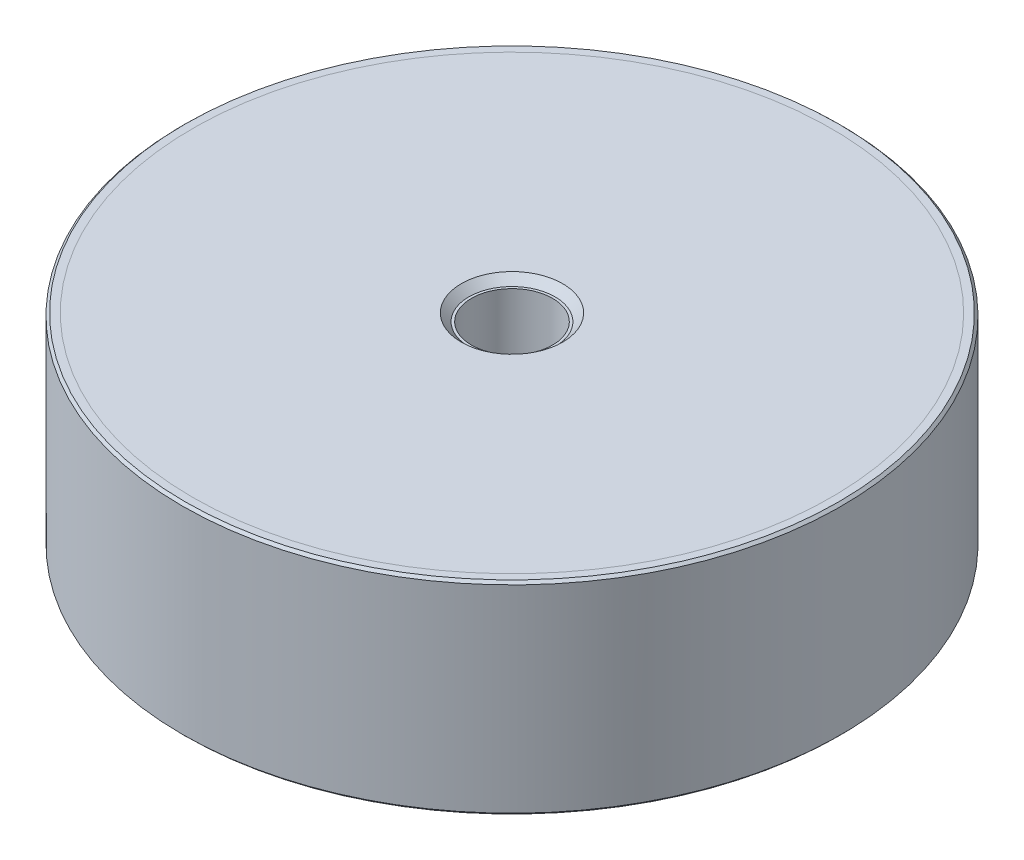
ISO-10303-21;
HEADER;
FILE_DESCRIPTION(('STEP AP214'),'2;1');
FILE_NAME('part.step','',(''),(''),'','','');
FILE_SCHEMA(('AUTOMOTIVE_DESIGN { 1 0 10303 214 1 1 1 1 }'));
ENDSEC;
DATA;
#1=APPLICATION_CONTEXT('core data for automotive mechanical design processes');
#2=APPLICATION_PROTOCOL_DEFINITION('international standard','automotive_design',2000,#1);
#3=PRODUCT_CONTEXT('',#1,'mechanical');
#4=PRODUCT('Part','Part','',(#3));
#5=PRODUCT_RELATED_PRODUCT_CATEGORY('part','',(#4));
#6=PRODUCT_DEFINITION_FORMATION('','',#4);
#7=PRODUCT_DEFINITION_CONTEXT('part definition',#1,'design');
#8=PRODUCT_DEFINITION('design','',#6,#7);
#9=PRODUCT_DEFINITION_SHAPE('','',#8);
#10=(LENGTH_UNIT() NAMED_UNIT(*) SI_UNIT(.MILLI.,.METRE.));
#11=(NAMED_UNIT(*) PLANE_ANGLE_UNIT() SI_UNIT($,.RADIAN.));
#12=(NAMED_UNIT(*) SI_UNIT($,.STERADIAN.) SOLID_ANGLE_UNIT());
#13=UNCERTAINTY_MEASURE_WITH_UNIT(LENGTH_MEASURE(1.E-05),#10,'distance_accuracy_value','');
#14=(GEOMETRIC_REPRESENTATION_CONTEXT(3) GLOBAL_UNCERTAINTY_ASSIGNED_CONTEXT((#13)) GLOBAL_UNIT_ASSIGNED_CONTEXT((#10,
#11,#12)) REPRESENTATION_CONTEXT('',''));
#15=CARTESIAN_POINT('',(0.,0.,0.));
#16=DIRECTION('',(0.,0.,1.));
#17=DIRECTION('',(1.,0.,0.));
#18=AXIS2_PLACEMENT_3D('',#15,#16,#17);
#19=CARTESIAN_POINT('',(0.,-37.,8.));
#20=DIRECTION('',(0.,1.,0.));
#21=DIRECTION('',(0.,0.,1.));
#22=AXIS2_PLACEMENT_3D('',#19,#20,#21);
#23=PLANE('',#22);
#24=CARTESIAN_POINT('',(0.,-37.,0.));
#25=DIRECTION('',(0.,1.,0.));
#26=DIRECTION('',(0.,0.,1.));
#27=AXIS2_PLACEMENT_3D('',#24,#25,#26);
#28=CIRCLE('',#27,8.50000000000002);
#29=CARTESIAN_POINT('',(0.,-37.,8.50000000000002));
#30=VERTEX_POINT('',#29);
#31=EDGE_CURVE('P0_E10',#30,#30,#28,.F.);
#32=ORIENTED_EDGE('',*,*,#31,.T.);
#33=EDGE_LOOP('',(#32));
#34=FACE_BOUND('',#33,.T.);
#35=CARTESIAN_POINT('',(0.,-37.,0.));
#36=DIRECTION('',(0.,1.,0.));
#37=DIRECTION('',(0.,0.,1.));
#38=AXIS2_PLACEMENT_3D('',#35,#36,#37);
#39=CIRCLE('',#38,63.);
#40=CARTESIAN_POINT('',(0.,-37.,63.));
#41=VERTEX_POINT('',#40);
#42=EDGE_CURVE('P0_E25',#41,#41,#39,.T.);
#43=ORIENTED_EDGE('',*,*,#42,.T.);
#44=EDGE_LOOP('',(#43));
#45=FACE_BOUND('',#44,.T.);
#46=ADVANCED_FACE('P0_F14',(#34,#45),#23,.T.);
#47=CARTESIAN_POINT('',(0.,31.0340428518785,0.));
#48=DIRECTION('',(0.,1.,0.));
#49=DIRECTION('',(0.,0.,1.));
#50=AXIS2_PLACEMENT_3D('',#47,#48,#49);
#51=CYLINDRICAL_SURFACE('',#50,63.);
#52=CARTESIAN_POINT('',(0.,-38.5,0.));
#53=DIRECTION('',(0.,1.,0.));
#54=DIRECTION('',(0.,0.,1.));
#55=AXIS2_PLACEMENT_3D('',#52,#53,#54);
#56=CIRCLE('',#55,63.);
#57=CARTESIAN_POINT('',(0.,-38.5,63.));
#58=VERTEX_POINT('',#57);
#59=EDGE_CURVE('P0_E29',#58,#58,#56,.T.);
#60=ORIENTED_EDGE('',*,*,#59,.T.);
#61=EDGE_LOOP('',(#60));
#62=FACE_BOUND('',#61,.T.);
#63=ORIENTED_EDGE('',*,*,#42,.F.);
#64=EDGE_LOOP('',(#63));
#65=FACE_BOUND('',#64,.T.);
#66=ADVANCED_FACE('P0_F35',(#62,#65),#51,.T.);
#67=CARTESIAN_POINT('',(0.,-38.5,63.));
#68=DIRECTION('',(0.,-1.,0.));
#69=DIRECTION('',(0.,0.,-1.));
#70=AXIS2_PLACEMENT_3D('',#67,#68,#69);
#71=PLANE('',#70);
#72=CARTESIAN_POINT('',(0.,-38.5,0.));
#73=DIRECTION('',(0.,-1.,0.));
#74=DIRECTION('',(0.,0.,-1.));
#75=AXIS2_PLACEMENT_3D('',#72,#73,#74);
#76=CIRCLE('',#75,10.);
#77=CARTESIAN_POINT('',(0.,-38.5,-10.));
#78=VERTEX_POINT('',#77);
#79=EDGE_CURVE('P0_E21',#78,#78,#76,.F.);
#80=ORIENTED_EDGE('',*,*,#79,.T.);
#81=EDGE_LOOP('',(#80));
#82=FACE_BOUND('',#81,.T.);
#83=ORIENTED_EDGE('',*,*,#59,.F.);
#84=EDGE_LOOP('',(#83));
#85=FACE_BOUND('',#84,.T.);
#86=ADVANCED_FACE('P0_F38',(#82,#85),#71,.T.);
#87=CARTESIAN_POINT('',(0.,-38.5,0.));
#88=DIRECTION('',(0.,-1.,0.));
#89=DIRECTION('',(0.,0.,-1.));
#90=AXIS2_PLACEMENT_3D('',#87,#88,#89);
#91=CONICAL_SURFACE('',#90,10.,0.785398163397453);
#92=ORIENTED_EDGE('',*,*,#31,.F.);
#93=EDGE_LOOP('',(#92));
#94=FACE_BOUND('',#93,.T.);
#95=ORIENTED_EDGE('',*,*,#79,.F.);
#96=EDGE_LOOP('',(#95));
#97=FACE_BOUND('',#96,.T.);
#98=ADVANCED_FACE('P0_F16',(#94,#97),#91,.F.);
#99=CLOSED_SHELL('',(#46,#66,#86,#98));
#100=MANIFOLD_SOLID_BREP('P0_B1',#99);
#101=CARTESIAN_POINT('',(0.,1.5,8.));
#102=DIRECTION('',(0.,1.,0.));
#103=DIRECTION('',(0.,0.,1.));
#104=AXIS2_PLACEMENT_3D('',#101,#102,#103);
#105=PLANE('',#104);
#106=CARTESIAN_POINT('',(0.,1.5,0.));
#107=DIRECTION('',(0.,1.,0.));
#108=DIRECTION('',(0.,0.,1.));
#109=AXIS2_PLACEMENT_3D('',#106,#107,#108);
#110=CIRCLE('',#109,10.);
#111=CARTESIAN_POINT('',(0.,1.5,10.));
#112=VERTEX_POINT('',#111);
#113=EDGE_CURVE('P1_E10',#112,#112,#110,.F.);
#114=ORIENTED_EDGE('',*,*,#113,.T.);
#115=EDGE_LOOP('',(#114));
#116=FACE_BOUND('',#115,.T.);
#117=CARTESIAN_POINT('',(0.,1.49999999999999,0.));
#118=DIRECTION('',(0.,1.,0.));
#119=DIRECTION('',(0.,0.,1.));
#120=AXIS2_PLACEMENT_3D('',#117,#118,#119);
#121=CIRCLE('',#120,63.);
#122=CARTESIAN_POINT('',(0.,1.49999999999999,63.));
#123=VERTEX_POINT('',#122);
#124=EDGE_CURVE('P1_E25',#123,#123,#121,.T.);
#125=ORIENTED_EDGE('',*,*,#124,.T.);
#126=EDGE_LOOP('',(#125));
#127=FACE_BOUND('',#126,.T.);
#128=ADVANCED_FACE('P1_F14',(#116,#127),#105,.T.);
#129=CARTESIAN_POINT('',(0.,69.5340428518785,0.));
#130=DIRECTION('',(0.,1.,0.));
#131=DIRECTION('',(0.,0.,1.));
#132=AXIS2_PLACEMENT_3D('',#129,#130,#131);
#133=CYLINDRICAL_SURFACE('',#132,63.);
#134=CARTESIAN_POINT('',(0.,0.,0.));
#135=DIRECTION('',(0.,1.,0.));
#136=DIRECTION('',(0.,0.,1.));
#137=AXIS2_PLACEMENT_3D('',#134,#135,#136);
#138=CIRCLE('',#137,63.);
#139=CARTESIAN_POINT('',(0.,0.,63.));
#140=VERTEX_POINT('',#139);
#141=EDGE_CURVE('P1_E29',#140,#140,#138,.T.);
#142=ORIENTED_EDGE('',*,*,#141,.T.);
#143=EDGE_LOOP('',(#142));
#144=FACE_BOUND('',#143,.T.);
#145=ORIENTED_EDGE('',*,*,#124,.F.);
#146=EDGE_LOOP('',(#145));
#147=FACE_BOUND('',#146,.T.);
#148=ADVANCED_FACE('P1_F35',(#144,#147),#133,.T.);
#149=CARTESIAN_POINT('',(0.,0.,63.));
#150=DIRECTION('',(0.,-1.,0.));
#151=DIRECTION('',(0.,0.,-1.));
#152=AXIS2_PLACEMENT_3D('',#149,#150,#151);
#153=PLANE('',#152);
#154=CARTESIAN_POINT('',(0.,0.,0.));
#155=DIRECTION('',(0.,-1.,0.));
#156=DIRECTION('',(0.,0.,-1.));
#157=AXIS2_PLACEMENT_3D('',#154,#155,#156);
#158=CIRCLE('',#157,8.50000000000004);
#159=CARTESIAN_POINT('',(0.,0.,-8.50000000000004));
#160=VERTEX_POINT('',#159);
#161=EDGE_CURVE('P1_E21',#160,#160,#158,.F.);
#162=ORIENTED_EDGE('',*,*,#161,.T.);
#163=EDGE_LOOP('',(#162));
#164=FACE_BOUND('',#163,.T.);
#165=ORIENTED_EDGE('',*,*,#141,.F.);
#166=EDGE_LOOP('',(#165));
#167=FACE_BOUND('',#166,.T.);
#168=ADVANCED_FACE('P1_F38',(#164,#167),#153,.T.);
#169=CARTESIAN_POINT('',(0.,-0.500000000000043,0.));
#170=DIRECTION('',(0.,1.,0.));
#171=DIRECTION('',(0.,0.,1.));
#172=AXIS2_PLACEMENT_3D('',#169,#170,#171);
#173=CONICAL_SURFACE('',#172,8.,0.785398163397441);
#174=ORIENTED_EDGE('',*,*,#113,.F.);
#175=EDGE_LOOP('',(#174));
#176=FACE_BOUND('',#175,.T.);
#177=ORIENTED_EDGE('',*,*,#161,.F.);
#178=EDGE_LOOP('',(#177));
#179=FACE_BOUND('',#178,.T.);
#180=ADVANCED_FACE('P1_F16',(#176,#179),#173,.F.);
#181=CLOSED_SHELL('',(#128,#148,#168,#180));
#182=MANIFOLD_SOLID_BREP('P1_B1',#181);
#183=CARTESIAN_POINT('',(0.,0.,0.));
#184=DIRECTION('',(0.,1.,0.));
#185=DIRECTION('',(0.,0.,1.));
#186=AXIS2_PLACEMENT_3D('',#183,#184,#185);
#187=PLANE('',#186);
#188=CARTESIAN_POINT('',(0.,0.,0.));
#189=DIRECTION('',(0.,1.,0.));
#190=DIRECTION('',(0.,0.,1.));
#191=AXIS2_PLACEMENT_3D('',#188,#189,#190);
#192=CIRCLE('',#191,8.);
#193=CARTESIAN_POINT('',(0.,0.,8.));
#194=VERTEX_POINT('',#193);
#195=EDGE_CURVE('P2_E46',#194,#194,#192,.T.);
#196=ORIENTED_EDGE('',*,*,#195,.F.);
#197=EDGE_LOOP('',(#196));
#198=FACE_BOUND('',#197,.T.);
#199=CARTESIAN_POINT('',(0.,0.,0.));
#200=DIRECTION('',(0.,1.,0.));
#201=DIRECTION('',(0.,0.,1.));
#202=AXIS2_PLACEMENT_3D('',#199,#200,#201);
#203=CIRCLE('',#202,63.);
#204=CARTESIAN_POINT('',(0.,0.,63.));
#205=VERTEX_POINT('',#204);
#206=EDGE_CURVE('P2_E33',#205,#205,#203,.T.);
#207=ORIENTED_EDGE('',*,*,#206,.T.);
#208=EDGE_LOOP('',(#207));
#209=FACE_BOUND('',#208,.T.);
#210=ADVANCED_FACE('P2_F13',(#198,#209),#187,.T.);
#211=CARTESIAN_POINT('',(0.,65.5134936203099,0.));
#212=DIRECTION('',(0.,1.,0.));
#213=DIRECTION('',(0.,0.,1.));
#214=AXIS2_PLACEMENT_3D('',#211,#212,#213);
#215=CYLINDRICAL_SURFACE('',#214,63.);
#216=CARTESIAN_POINT('',(0.,1.49999999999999,0.));
#217=DIRECTION('',(0.,1.,0.));
#218=DIRECTION('',(0.,0.,1.));
#219=AXIS2_PLACEMENT_3D('',#216,#217,#218);
#220=CIRCLE('',#219,63.);
#221=CARTESIAN_POINT('',(0.,1.49999999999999,63.));
#222=VERTEX_POINT('',#221);
#223=EDGE_CURVE('P2_E36',#222,#222,#220,.T.);
#224=ORIENTED_EDGE('',*,*,#223,.T.);
#225=EDGE_LOOP('',(#224));
#226=FACE_BOUND('',#225,.T.);
#227=ORIENTED_EDGE('',*,*,#206,.F.);
#228=EDGE_LOOP('',(#227));
#229=FACE_BOUND('',#228,.T.);
#230=ADVANCED_FACE('P2_F92',(#226,#229),#215,.F.);
#231=CARTESIAN_POINT('',(0.,1.49999999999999,63.));
#232=DIRECTION('',(0.,1.,0.));
#233=DIRECTION('',(0.,0.,1.));
#234=AXIS2_PLACEMENT_3D('',#231,#232,#233);
#235=PLANE('',#234);
#236=CARTESIAN_POINT('',(0.,1.49999999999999,0.));
#237=DIRECTION('',(0.,1.,0.));
#238=DIRECTION('',(0.,0.,1.));
#239=AXIS2_PLACEMENT_3D('',#236,#237,#238);
#240=CIRCLE('',#239,64.5);
#241=CARTESIAN_POINT('',(0.,1.49999999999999,64.5));
#242=VERTEX_POINT('',#241);
#243=EDGE_CURVE('P2_E9',#242,#242,#240,.T.);
#244=ORIENTED_EDGE('',*,*,#243,.T.);
#245=EDGE_LOOP('',(#244));
#246=FACE_BOUND('',#245,.T.);
#247=ORIENTED_EDGE('',*,*,#223,.F.);
#248=EDGE_LOOP('',(#247));
#249=FACE_BOUND('',#248,.T.);
#250=ADVANCED_FACE('P2_F88',(#246,#249),#235,.T.);
#251=CARTESIAN_POINT('',(0.,65.5134936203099,0.));
#252=DIRECTION('',(0.,1.,0.));
#253=DIRECTION('',(0.,0.,1.));
#254=AXIS2_PLACEMENT_3D('',#251,#252,#253);
#255=CYLINDRICAL_SURFACE('',#254,65.);
#256=CARTESIAN_POINT('',(0.,-38.,0.));
#257=DIRECTION('',(0.,-1.,0.));
#258=DIRECTION('',(0.,0.,-1.));
#259=AXIS2_PLACEMENT_3D('',#256,#257,#258);
#260=CIRCLE('',#259,65.);
#261=CARTESIAN_POINT('',(0.,-38.,-65.));
#262=VERTEX_POINT('',#261);
#263=EDGE_CURVE('P2_E24',#262,#262,#260,.F.);
#264=ORIENTED_EDGE('',*,*,#263,.T.);
#265=EDGE_LOOP('',(#264));
#266=FACE_BOUND('',#265,.T.);
#267=CARTESIAN_POINT('',(0.,0.999999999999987,0.));
#268=DIRECTION('',(0.,1.,0.));
#269=DIRECTION('',(0.,0.,1.));
#270=AXIS2_PLACEMENT_3D('',#267,#268,#269);
#271=CIRCLE('',#270,65.);
#272=CARTESIAN_POINT('',(0.,0.999999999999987,65.));
#273=VERTEX_POINT('',#272);
#274=EDGE_CURVE('P2_E28',#273,#273,#271,.F.);
#275=ORIENTED_EDGE('',*,*,#274,.T.);
#276=EDGE_LOOP('',(#275));
#277=FACE_BOUND('',#276,.T.);
#278=ADVANCED_FACE('P2_F82',(#266,#277),#255,.T.);
#279=CARTESIAN_POINT('',(0.,-38.5,65.));
#280=DIRECTION('',(0.,-1.,0.));
#281=DIRECTION('',(0.,0.,-1.));
#282=AXIS2_PLACEMENT_3D('',#279,#280,#281);
#283=PLANE('',#282);
#284=CARTESIAN_POINT('',(0.,-38.5,0.));
#285=DIRECTION('',(0.,-1.,0.));
#286=DIRECTION('',(0.,0.,-1.));
#287=AXIS2_PLACEMENT_3D('',#284,#285,#286);
#288=CIRCLE('',#287,64.5);
#289=CARTESIAN_POINT('',(0.,-38.5,-64.5));
#290=VERTEX_POINT('',#289);
#291=EDGE_CURVE('P2_E20',#290,#290,#288,.T.);
#292=ORIENTED_EDGE('',*,*,#291,.T.);
#293=EDGE_LOOP('',(#292));
#294=FACE_BOUND('',#293,.T.);
#295=CARTESIAN_POINT('',(0.,-38.5,0.));
#296=DIRECTION('',(0.,1.,0.));
#297=DIRECTION('',(0.,0.,1.));
#298=AXIS2_PLACEMENT_3D('',#295,#296,#297);
#299=CIRCLE('',#298,63.);
#300=CARTESIAN_POINT('',(0.,-38.5,63.));
#301=VERTEX_POINT('',#300);
#302=EDGE_CURVE('P2_E39',#301,#301,#299,.T.);
#303=ORIENTED_EDGE('',*,*,#302,.T.);
#304=EDGE_LOOP('',(#303));
#305=FACE_BOUND('',#304,.T.);
#306=ADVANCED_FACE('P2_F77',(#294,#305),#283,.T.);
#307=CARTESIAN_POINT('',(0.,65.5134936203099,0.));
#308=DIRECTION('',(0.,1.,0.));
#309=DIRECTION('',(0.,0.,1.));
#310=AXIS2_PLACEMENT_3D('',#307,#308,#309);
#311=CYLINDRICAL_SURFACE('',#310,63.);
#312=CARTESIAN_POINT('',(0.,-37.,0.));
#313=DIRECTION('',(0.,1.,0.));
#314=DIRECTION('',(0.,0.,1.));
#315=AXIS2_PLACEMENT_3D('',#312,#313,#314);
#316=CIRCLE('',#315,63.);
#317=CARTESIAN_POINT('',(0.,-37.,63.));
#318=VERTEX_POINT('',#317);
#319=EDGE_CURVE('P2_E42',#318,#318,#316,.T.);
#320=ORIENTED_EDGE('',*,*,#319,.T.);
#321=EDGE_LOOP('',(#320));
#322=FACE_BOUND('',#321,.T.);
#323=ORIENTED_EDGE('',*,*,#302,.F.);
#324=EDGE_LOOP('',(#323));
#325=FACE_BOUND('',#324,.T.);
#326=ADVANCED_FACE('P2_F71',(#322,#325),#311,.F.);
#327=CARTESIAN_POINT('',(0.,-37.,63.));
#328=DIRECTION('',(0.,-1.,0.));
#329=DIRECTION('',(0.,0.,-1.));
#330=AXIS2_PLACEMENT_3D('',#327,#328,#329);
#331=PLANE('',#330);
#332=CARTESIAN_POINT('',(0.,-37.,0.));
#333=DIRECTION('',(0.,-1.,0.));
#334=DIRECTION('',(0.,0.,-1.));
#335=AXIS2_PLACEMENT_3D('',#332,#333,#334);
#336=CIRCLE('',#335,8.);
#337=CARTESIAN_POINT('',(0.,-37.,-8.));
#338=VERTEX_POINT('',#337);
#339=EDGE_CURVE('P2_E52',#338,#338,#336,.T.);
#340=ORIENTED_EDGE('',*,*,#339,.F.);
#341=EDGE_LOOP('',(#340));
#342=FACE_BOUND('',#341,.T.);
#343=ORIENTED_EDGE('',*,*,#319,.F.);
#344=EDGE_LOOP('',(#343));
#345=FACE_BOUND('',#344,.T.);
#346=ADVANCED_FACE('P2_F67',(#342,#345),#331,.T.);
#347=CARTESIAN_POINT('',(0.,-38.,0.));
#348=DIRECTION('',(0.,1.,0.));
#349=DIRECTION('',(0.,0.,1.));
#350=AXIS2_PLACEMENT_3D('',#347,#348,#349);
#351=CONICAL_SURFACE('',#350,65.,0.785398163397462);
#352=ORIENTED_EDGE('',*,*,#291,.F.);
#353=EDGE_LOOP('',(#352));
#354=FACE_BOUND('',#353,.T.);
#355=ORIENTED_EDGE('',*,*,#263,.F.);
#356=EDGE_LOOP('',(#355));
#357=FACE_BOUND('',#356,.T.);
#358=ADVANCED_FACE('P2_F70',(#354,#357),#351,.T.);
#359=CARTESIAN_POINT('',(0.,1.49999999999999,0.));
#360=DIRECTION('',(0.,-1.,0.));
#361=DIRECTION('',(0.,0.,-1.));
#362=AXIS2_PLACEMENT_3D('',#359,#360,#361);
#363=CONICAL_SURFACE('',#362,64.5,0.785398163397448);
#364=ORIENTED_EDGE('',*,*,#274,.F.);
#365=EDGE_LOOP('',(#364));
#366=FACE_BOUND('',#365,.T.);
#367=ORIENTED_EDGE('',*,*,#243,.F.);
#368=EDGE_LOOP('',(#367));
#369=FACE_BOUND('',#368,.T.);
#370=ADVANCED_FACE('P2_F15',(#366,#369),#363,.T.);
#371=CARTESIAN_POINT('',(0.,-14.5,0.));
#372=DIRECTION('',(0.,1.,0.));
#373=DIRECTION('',(0.,0.,1.));
#374=AXIS2_PLACEMENT_3D('',#371,#372,#373);
#375=CYLINDRICAL_SURFACE('',#374,8.);
#376=CARTESIAN_POINT('',(0.,-14.5,0.));
#377=DIRECTION('',(0.,1.,0.));
#378=DIRECTION('',(0.,0.,1.));
#379=AXIS2_PLACEMENT_3D('',#376,#377,#378);
#380=CIRCLE('',#379,8.);
#381=CARTESIAN_POINT('',(0.,-14.5,8.));
#382=VERTEX_POINT('',#381);
#383=EDGE_CURVE('P2_E45',#382,#382,#380,.T.);
#384=CARTESIAN_POINT('',(0.,-14.5,8.));
#385=CARTESIAN_POINT('',(0.,-14.3489583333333,8.));
#386=CARTESIAN_POINT('',(0.,-14.1979166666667,8.));
#387=CARTESIAN_POINT('',(0.,-13.8958333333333,8.));
#388=CARTESIAN_POINT('',(0.,-13.7447916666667,8.));
#389=CARTESIAN_POINT('',(0.,-13.4427083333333,8.));
#390=CARTESIAN_POINT('',(0.,-13.2916666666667,8.));
#391=CARTESIAN_POINT('',(0.,-12.9895833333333,8.));
#392=CARTESIAN_POINT('',(0.,-12.8385416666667,8.));
#393=CARTESIAN_POINT('',(0.,-12.5364583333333,8.));
#394=CARTESIAN_POINT('',(0.,-12.3854166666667,8.));
#395=CARTESIAN_POINT('',(0.,-12.0833333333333,8.));
#396=CARTESIAN_POINT('',(0.,-11.9322916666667,8.));
#397=CARTESIAN_POINT('',(0.,-11.6302083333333,8.));
#398=CARTESIAN_POINT('',(0.,-11.4791666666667,8.));
#399=CARTESIAN_POINT('',(0.,-11.1770833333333,8.));
#400=CARTESIAN_POINT('',(0.,-11.0260416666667,8.));
#401=CARTESIAN_POINT('',(0.,-10.7239583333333,8.));
#402=CARTESIAN_POINT('',(0.,-10.5729166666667,8.));
#403=CARTESIAN_POINT('',(0.,-10.2708333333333,8.));
#404=CARTESIAN_POINT('',(0.,-10.1197916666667,8.));
#405=CARTESIAN_POINT('',(0.,-9.81770833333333,8.));
#406=CARTESIAN_POINT('',(0.,-9.66666666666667,8.));
#407=CARTESIAN_POINT('',(0.,-9.36458333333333,8.));
#408=CARTESIAN_POINT('',(0.,-9.21354166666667,8.));
#409=CARTESIAN_POINT('',(0.,-8.91145833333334,8.));
#410=CARTESIAN_POINT('',(0.,-8.76041666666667,8.));
#411=CARTESIAN_POINT('',(0.,-8.45833333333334,8.));
#412=CARTESIAN_POINT('',(0.,-8.30729166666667,8.));
#413=CARTESIAN_POINT('',(0.,-8.00520833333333,8.));
#414=CARTESIAN_POINT('',(0.,-7.85416666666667,8.));
#415=CARTESIAN_POINT('',(0.,-7.55208333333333,8.));
#416=CARTESIAN_POINT('',(0.,-7.40104166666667,8.));
#417=CARTESIAN_POINT('',(0.,-7.09895833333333,8.));
#418=CARTESIAN_POINT('',(0.,-6.94791666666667,8.));
#419=CARTESIAN_POINT('',(0.,-6.64583333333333,8.));
#420=CARTESIAN_POINT('',(0.,-6.49479166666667,8.));
#421=CARTESIAN_POINT('',(0.,-6.19270833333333,8.));
#422=CARTESIAN_POINT('',(0.,-6.04166666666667,8.));
#423=CARTESIAN_POINT('',(0.,-5.73958333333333,8.));
#424=CARTESIAN_POINT('',(0.,-5.58854166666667,8.));
#425=CARTESIAN_POINT('',(0.,-5.28645833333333,8.));
#426=CARTESIAN_POINT('',(0.,-5.13541666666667,8.));
#427=CARTESIAN_POINT('',(0.,-4.83333333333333,8.));
#428=CARTESIAN_POINT('',(0.,-4.68229166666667,8.));
#429=CARTESIAN_POINT('',(0.,-4.38020833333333,8.));
#430=CARTESIAN_POINT('',(0.,-4.22916666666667,8.));
#431=CARTESIAN_POINT('',(0.,-3.92708333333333,8.));
#432=CARTESIAN_POINT('',(0.,-3.77604166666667,8.));
#433=CARTESIAN_POINT('',(0.,-3.47395833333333,8.));
#434=CARTESIAN_POINT('',(0.,-3.32291666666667,8.));
#435=CARTESIAN_POINT('',(0.,-3.02083333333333,8.));
#436=CARTESIAN_POINT('',(0.,-2.86979166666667,8.));
#437=CARTESIAN_POINT('',(0.,-2.56770833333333,8.));
#438=CARTESIAN_POINT('',(0.,-2.41666666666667,8.));
#439=CARTESIAN_POINT('',(0.,-2.11458333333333,8.));
#440=CARTESIAN_POINT('',(0.,-1.96354166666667,8.));
#441=CARTESIAN_POINT('',(0.,-1.66145833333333,8.));
#442=CARTESIAN_POINT('',(0.,-1.51041666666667,8.));
#443=CARTESIAN_POINT('',(0.,-1.20833333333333,8.));
#444=CARTESIAN_POINT('',(0.,-1.05729166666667,8.));
#445=CARTESIAN_POINT('',(0.,-0.755208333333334,8.));
#446=CARTESIAN_POINT('',(0.,-0.604166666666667,8.));
#447=CARTESIAN_POINT('',(0.,-0.302083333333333,8.));
#448=CARTESIAN_POINT('',(0.,-0.151041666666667,8.));
#449=CARTESIAN_POINT('',(0.,0.,8.));
#450=B_SPLINE_CURVE_WITH_KNOTS('',3,(#384,#385,#386,#387,#388,#389,#390,#391,#392,#393,#394,
#395,#396,#397,#398,#399,#400,#401,#402,#403,#404,#405,#406,#407,#408,#409,#410,#411,#412,#413,
#414,#415,#416,#417,#418,#419,#420,#421,#422,#423,#424,#425,#426,#427,#428,#429,#430,#431,#432,
#433,#434,#435,#436,#437,#438,#439,#440,#441,#442,#443,#444,#445,#446,#447,#448,#449),
.UNSPECIFIED.,.F.,.F.,(4,2,2,2,2,2,2,2,2,2,2,2,2,2,2,2,2,2,2,2,2,2,2,2,2,2,2,2,2,2,2,2,4),(0.,
0.453124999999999,0.906249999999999,1.359375,1.8125,2.265625,2.71875,3.171875,3.625,4.078125,
4.53125,4.984375,5.4375,5.890625,6.34375,6.796875,7.25,7.703125,8.15625,8.609375,9.0625,
9.515625,9.96875,10.421875,10.875,11.328125,11.78125,12.234375,12.6875,13.140625,13.59375,
14.046875,14.5),.UNSPECIFIED.);
#451=EDGE_CURVE('P2_BSEAM108',#382,#194,#450,.T.);
#452=ORIENTED_EDGE('',*,*,#383,.F.);
#453=ORIENTED_EDGE('',*,*,#195,.T.);
#454=ORIENTED_EDGE('',*,*,#451,.T.);
#455=ORIENTED_EDGE('',*,*,#451,.F.);
#456=EDGE_LOOP('',(#452,#454,#453,#455));
#457=FACE_BOUND('',#456,.T.);
#458=ADVANCED_FACE('P2_F108',(#457),#375,.F.);
#459=CARTESIAN_POINT('',(0.,-14.5,0.));
#460=DIRECTION('',(0.,1.,0.));
#461=DIRECTION('',(0.,0.,1.));
#462=AXIS2_PLACEMENT_3D('',#459,#460,#461);
#463=PLANE('',#462);
#464=ORIENTED_EDGE('',*,*,#383,.T.);
#465=EDGE_LOOP('',(#464));
#466=FACE_BOUND('',#465,.T.);
#467=ADVANCED_FACE('P2_F63',(#466),#463,.T.);
#468=CARTESIAN_POINT('',(0.,-22.5,0.));
#469=DIRECTION('',(0.,-1.,0.));
#470=DIRECTION('',(0.,0.,-1.));
#471=AXIS2_PLACEMENT_3D('',#468,#469,#470);
#472=CYLINDRICAL_SURFACE('',#471,8.);
#473=CARTESIAN_POINT('',(0.,-22.5,0.));
#474=DIRECTION('',(0.,-1.,0.));
#475=DIRECTION('',(0.,0.,-1.));
#476=AXIS2_PLACEMENT_3D('',#473,#474,#475);
#477=CIRCLE('',#476,8.);
#478=CARTESIAN_POINT('',(0.,-22.5,-8.));
#479=VERTEX_POINT('',#478);
#480=EDGE_CURVE('P2_E49',#479,#479,#477,.T.);
#481=CARTESIAN_POINT('',(0.,-22.5,-8.));
#482=CARTESIAN_POINT('',(0.,-22.6510416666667,-8.));
#483=CARTESIAN_POINT('',(0.,-22.8020833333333,-8.));
#484=CARTESIAN_POINT('',(0.,-23.1041666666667,-8.));
#485=CARTESIAN_POINT('',(0.,-23.2552083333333,-8.));
#486=CARTESIAN_POINT('',(0.,-23.5572916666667,-8.));
#487=CARTESIAN_POINT('',(0.,-23.7083333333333,-8.));
#488=CARTESIAN_POINT('',(0.,-24.0104166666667,-8.));
#489=CARTESIAN_POINT('',(0.,-24.1614583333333,-8.));
#490=CARTESIAN_POINT('',(0.,-24.4635416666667,-8.));
#491=CARTESIAN_POINT('',(0.,-24.6145833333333,-8.));
#492=CARTESIAN_POINT('',(0.,-24.9166666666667,-8.));
#493=CARTESIAN_POINT('',(0.,-25.0677083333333,-8.));
#494=CARTESIAN_POINT('',(0.,-25.3697916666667,-8.));
#495=CARTESIAN_POINT('',(0.,-25.5208333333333,-8.));
#496=CARTESIAN_POINT('',(0.,-25.8229166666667,-8.));
#497=CARTESIAN_POINT('',(0.,-25.9739583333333,-8.));
#498=CARTESIAN_POINT('',(0.,-26.2760416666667,-8.));
#499=CARTESIAN_POINT('',(0.,-26.4270833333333,-8.));
#500=CARTESIAN_POINT('',(0.,-26.7291666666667,-8.));
#501=CARTESIAN_POINT('',(0.,-26.8802083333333,-8.));
#502=CARTESIAN_POINT('',(0.,-27.1822916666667,-8.));
#503=CARTESIAN_POINT('',(0.,-27.3333333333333,-8.));
#504=CARTESIAN_POINT('',(0.,-27.6354166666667,-8.));
#505=CARTESIAN_POINT('',(0.,-27.7864583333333,-8.));
#506=CARTESIAN_POINT('',(0.,-28.0885416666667,-8.));
#507=CARTESIAN_POINT('',(0.,-28.2395833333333,-8.));
#508=CARTESIAN_POINT('',(0.,-28.5416666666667,-8.));
#509=CARTESIAN_POINT('',(0.,-28.6927083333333,-8.));
#510=CARTESIAN_POINT('',(0.,-28.9947916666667,-8.));
#511=CARTESIAN_POINT('',(0.,-29.1458333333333,-8.));
#512=CARTESIAN_POINT('',(0.,-29.4479166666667,-8.));
#513=CARTESIAN_POINT('',(0.,-29.5989583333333,-8.));
#514=CARTESIAN_POINT('',(0.,-29.9010416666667,-8.));
#515=CARTESIAN_POINT('',(0.,-30.0520833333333,-8.));
#516=CARTESIAN_POINT('',(0.,-30.3541666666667,-8.));
#517=CARTESIAN_POINT('',(0.,-30.5052083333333,-8.));
#518=CARTESIAN_POINT('',(0.,-30.8072916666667,-8.));
#519=CARTESIAN_POINT('',(0.,-30.9583333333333,-8.));
#520=CARTESIAN_POINT('',(0.,-31.2604166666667,-8.));
#521=CARTESIAN_POINT('',(0.,-31.4114583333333,-8.));
#522=CARTESIAN_POINT('',(0.,-31.7135416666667,-8.));
#523=CARTESIAN_POINT('',(0.,-31.8645833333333,-8.));
#524=CARTESIAN_POINT('',(0.,-32.1666666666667,-8.));
#525=CARTESIAN_POINT('',(0.,-32.3177083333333,-8.));
#526=CARTESIAN_POINT('',(0.,-32.6197916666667,-8.));
#527=CARTESIAN_POINT('',(0.,-32.7708333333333,-8.));
#528=CARTESIAN_POINT('',(0.,-33.0729166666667,-8.));
#529=CARTESIAN_POINT('',(0.,-33.2239583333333,-8.));
#530=CARTESIAN_POINT('',(0.,-33.5260416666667,-8.));
#531=CARTESIAN_POINT('',(0.,-33.6770833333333,-8.));
#532=CARTESIAN_POINT('',(0.,-33.9791666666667,-8.));
#533=CARTESIAN_POINT('',(0.,-34.1302083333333,-8.));
#534=CARTESIAN_POINT('',(0.,-34.4322916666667,-8.));
#535=CARTESIAN_POINT('',(0.,-34.5833333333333,-8.));
#536=CARTESIAN_POINT('',(0.,-34.8854166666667,-8.));
#537=CARTESIAN_POINT('',(0.,-35.0364583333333,-8.));
#538=CARTESIAN_POINT('',(0.,-35.3385416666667,-8.));
#539=CARTESIAN_POINT('',(0.,-35.4895833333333,-8.));
#540=CARTESIAN_POINT('',(0.,-35.7916666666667,-8.));
#541=CARTESIAN_POINT('',(0.,-35.9427083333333,-8.));
#542=CARTESIAN_POINT('',(0.,-36.2447916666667,-8.));
#543=CARTESIAN_POINT('',(0.,-36.3958333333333,-8.));
#544=CARTESIAN_POINT('',(0.,-36.6979166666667,-8.));
#545=CARTESIAN_POINT('',(0.,-36.8489583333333,-8.));
#546=CARTESIAN_POINT('',(0.,-37.,-8.));
#547=B_SPLINE_CURVE_WITH_KNOTS('',3,(#481,#482,#483,#484,#485,#486,#487,#488,#489,#490,#491,
#492,#493,#494,#495,#496,#497,#498,#499,#500,#501,#502,#503,#504,#505,#506,#507,#508,#509,#510,
#511,#512,#513,#514,#515,#516,#517,#518,#519,#520,#521,#522,#523,#524,#525,#526,#527,#528,#529,
#530,#531,#532,#533,#534,#535,#536,#537,#538,#539,#540,#541,#542,#543,#544,#545,#546),
.UNSPECIFIED.,.F.,.F.,(4,2,2,2,2,2,2,2,2,2,2,2,2,2,2,2,2,2,2,2,2,2,2,2,2,2,2,2,2,2,2,2,4),(0.,
0.453124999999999,0.906249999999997,1.359375,1.8125,2.265625,2.71875,3.171875,3.625,
4.07812499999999,4.53125,4.984375,5.4375,5.890625,6.34375,6.796875,7.25,7.70312499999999,
8.15625,8.60937499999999,9.06249999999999,9.51562499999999,9.96875,10.421875,10.875,11.328125,
11.78125,12.234375,12.6875,13.140625,13.59375,14.046875,14.5),.UNSPECIFIED.);
#548=EDGE_CURVE('P2_BSEAM60',#479,#338,#547,.T.);
#549=ORIENTED_EDGE('',*,*,#480,.F.);
#550=ORIENTED_EDGE('',*,*,#339,.T.);
#551=ORIENTED_EDGE('',*,*,#548,.T.);
#552=ORIENTED_EDGE('',*,*,#548,.F.);
#553=EDGE_LOOP('',(#549,#551,#550,#552));
#554=FACE_BOUND('',#553,.T.);
#555=ADVANCED_FACE('P2_F60',(#554),#472,.F.);
#556=CARTESIAN_POINT('',(0.,-22.5,0.));
#557=DIRECTION('',(0.,-1.,0.));
#558=DIRECTION('',(0.,0.,-1.));
#559=AXIS2_PLACEMENT_3D('',#556,#557,#558);
#560=PLANE('',#559);
#561=ORIENTED_EDGE('',*,*,#480,.T.);
#562=EDGE_LOOP('',(#561));
#563=FACE_BOUND('',#562,.T.);
#564=ADVANCED_FACE('P2_F58',(#563),#560,.T.);
#565=CLOSED_SHELL('',(#210,#230,#250,#278,#306,#326,#346,#358,#370,#458,#467,#555,#564));
#566=MANIFOLD_SOLID_BREP('P2_B1',#565);
#567=ADVANCED_BREP_SHAPE_REPRESENTATION('',(#18,#100,#182,#566),#14);
#568=SHAPE_DEFINITION_REPRESENTATION(#9,#567);
ENDSEC;
END-ISO-10303-21;
